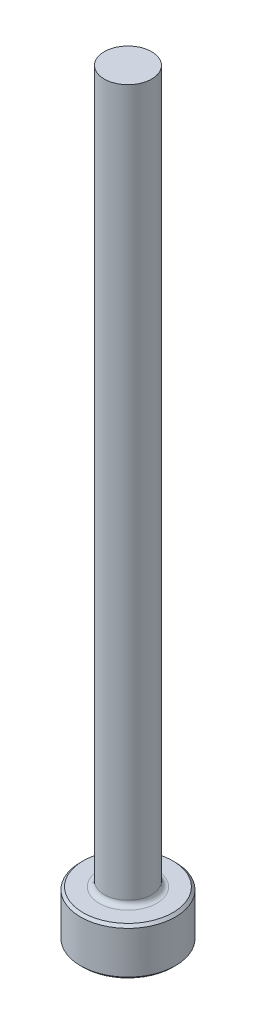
from build123d import *

# Parameters (mm, degrees)
CHAMFER1_SIZE = 0.254
FILLET1_R     = 0.508


with BuildPart() as part:
    # Sketch1 → Revolve1 (revolve)
    with BuildSketch(Plane.XY, mode=Mode.PRIVATE) as revolve1_sk:
        Polygon((0, 0), (-4.7625, 0), (-4.7625, 4.7498), (-2.38125, 4.7498), (-2.38125, 76.2), (0, 76.2), align=None)
    revolve(revolve1_sk.sketch.rotate(Axis((0, 259.958771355, 0), (0, -1, 0)), 270), axis=Axis((0, 259.958771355, 0), (0, -1, 0)))

    # Chamfer1
    chamfer1_edges = [part.edges().sort_by_distance(p)[0] for p in [
        (0, 4.7498, -4.7625),
        (0, 0, -4.7625),
    ]]
    chamfer(chamfer1_edges, length=CHAMFER1_SIZE)

    # Fillet1
    fillet1_edges = [part.edges().sort_by_distance(p)[0] for p in [
        (0, 4.7498, -2.38125),
    ]]
    fillet(fillet1_edges, radius=FILLET1_R)


solid = part.part
